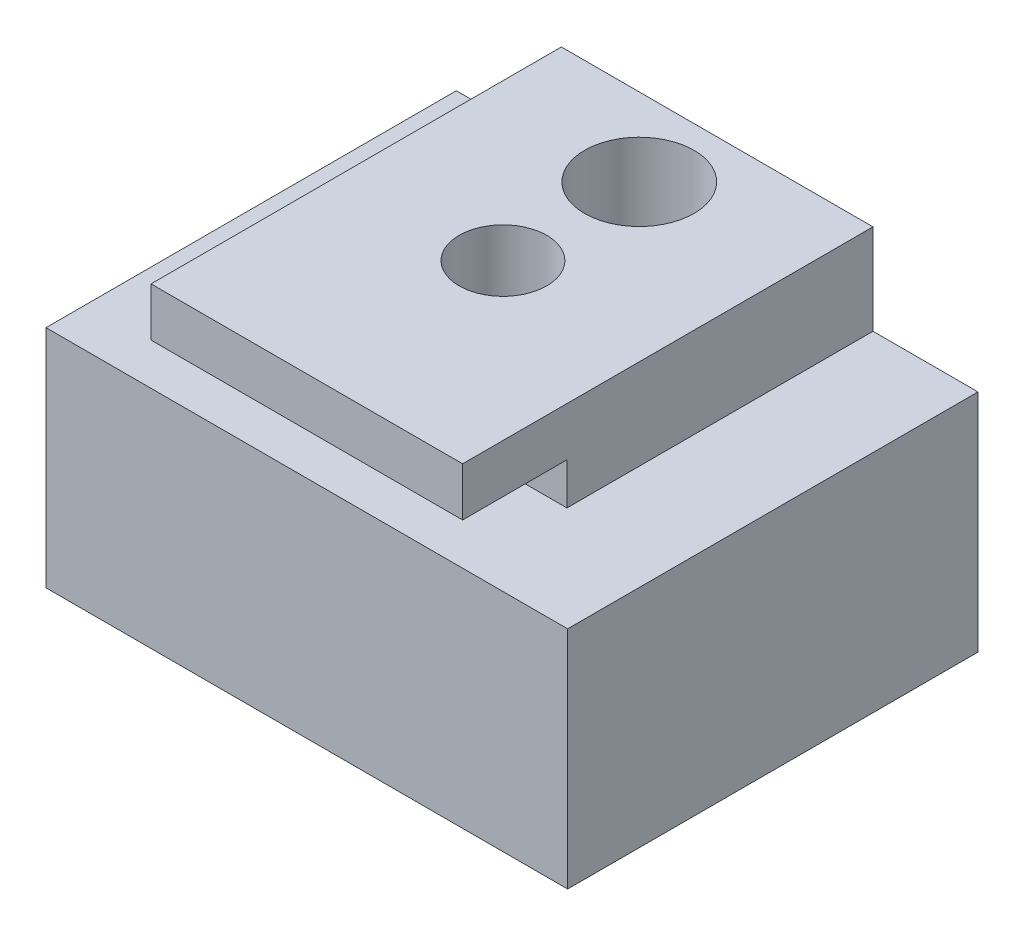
ISO-10303-21;
HEADER;
FILE_DESCRIPTION(('STEP AP214'),'2;1');
FILE_NAME('part.step','',(''),(''),'','','');
FILE_SCHEMA(('AUTOMOTIVE_DESIGN { 1 0 10303 214 1 1 1 1 }'));
ENDSEC;
DATA;
#1=APPLICATION_CONTEXT('core data for automotive mechanical design processes');
#2=APPLICATION_PROTOCOL_DEFINITION('international standard','automotive_design',2000,#1);
#3=PRODUCT_CONTEXT('',#1,'mechanical');
#4=PRODUCT('Part','Part','',(#3));
#5=PRODUCT_RELATED_PRODUCT_CATEGORY('part','',(#4));
#6=PRODUCT_DEFINITION_FORMATION('','',#4);
#7=PRODUCT_DEFINITION_CONTEXT('part definition',#1,'design');
#8=PRODUCT_DEFINITION('design','',#6,#7);
#9=PRODUCT_DEFINITION_SHAPE('','',#8);
#10=(LENGTH_UNIT() NAMED_UNIT(*) SI_UNIT(.MILLI.,.METRE.));
#11=(NAMED_UNIT(*) PLANE_ANGLE_UNIT() SI_UNIT($,.RADIAN.));
#12=(NAMED_UNIT(*) SI_UNIT($,.STERADIAN.) SOLID_ANGLE_UNIT());
#13=UNCERTAINTY_MEASURE_WITH_UNIT(LENGTH_MEASURE(1.E-05),#10,'distance_accuracy_value','');
#14=(GEOMETRIC_REPRESENTATION_CONTEXT(3) GLOBAL_UNCERTAINTY_ASSIGNED_CONTEXT((#13)) GLOBAL_UNIT_ASSIGNED_CONTEXT((#10,
#11,#12)) REPRESENTATION_CONTEXT('',''));
#15=CARTESIAN_POINT('',(0.,0.,0.));
#16=DIRECTION('',(0.,0.,1.));
#17=DIRECTION('',(1.,0.,0.));
#18=AXIS2_PLACEMENT_3D('',#15,#16,#17);
#19=CARTESIAN_POINT('',(-4.7625,2.0574,3.7465));
#20=DIRECTION('',(0.,0.,-1.));
#21=DIRECTION('',(-1.,0.,0.));
#22=AXIS2_PLACEMENT_3D('',#19,#20,#21);
#23=PLANE('',#22);
#24=DIRECTION('',(0.,-1.,0.));
#25=VECTOR('',#24,1.);
#26=CARTESIAN_POINT('',(-2.8448,3.7084,3.7465));
#27=LINE('',#26,#25);
#28=CARTESIAN_POINT('',(-2.8448,3.7084,3.7465));
#29=VERTEX_POINT('',#28);
#30=CARTESIAN_POINT('',(-2.8448,2.8194,3.7465));
#31=VERTEX_POINT('',#30);
#32=EDGE_CURVE('E161',#29,#31,#27,.T.);
#33=ORIENTED_EDGE('',*,*,#32,.T.);
#34=DIRECTION('',(1.,0.,0.));
#35=VECTOR('',#34,1.);
#36=CARTESIAN_POINT('',(-4.762525,2.8194,3.7465));
#37=LINE('',#36,#35);
#38=CARTESIAN_POINT('',(2.8448,2.8194,3.7465));
#39=VERTEX_POINT('',#38);
#40=EDGE_CURVE('E130',#31,#39,#37,.T.);
#41=ORIENTED_EDGE('',*,*,#40,.T.);
#42=DIRECTION('',(0.,-1.,0.));
#43=VECTOR('',#42,1.);
#44=CARTESIAN_POINT('',(2.8448,3.7084,3.7465));
#45=LINE('',#44,#43);
#46=CARTESIAN_POINT('',(2.8448,3.7084,3.7465));
#47=VERTEX_POINT('',#46);
#48=EDGE_CURVE('E165',#47,#39,#45,.T.);
#49=ORIENTED_EDGE('',*,*,#48,.F.);
#50=DIRECTION('',(1.,0.,0.));
#51=VECTOR('',#50,1.);
#52=CARTESIAN_POINT('',(2.8448,3.7084,3.7465));
#53=LINE('',#52,#51);
#54=EDGE_CURVE('E150',#29,#47,#53,.T.);
#55=ORIENTED_EDGE('',*,*,#54,.F.);
#56=EDGE_LOOP('',(#33,#41,#49,#55));
#57=FACE_BOUND('',#56,.T.);
#58=ADVANCED_FACE('F37',(#57),#23,.F.);
#59=CARTESIAN_POINT('',(-4.76249999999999,2.0574,-3.7465));
#60=DIRECTION('',(1.,0.,0.));
#61=DIRECTION('',(0.,0.,-1.));
#62=AXIS2_PLACEMENT_3D('',#59,#60,#61);
#63=PLANE('',#62);
#64=DIRECTION('',(0.,0.,1.));
#65=VECTOR('',#64,1.);
#66=CARTESIAN_POINT('',(-4.76249999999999,-2.0574,-3.7465));
#67=LINE('',#66,#65);
#68=CARTESIAN_POINT('',(-4.76249999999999,-2.0574,-3.7465));
#69=VERTEX_POINT('',#68);
#70=CARTESIAN_POINT('',(-4.7625,-2.0574,3.7465));
#71=VERTEX_POINT('',#70);
#72=EDGE_CURVE('E174',#69,#71,#67,.T.);
#73=ORIENTED_EDGE('',*,*,#72,.T.);
#74=DIRECTION('',(0.,-1.,0.));
#75=VECTOR('',#74,1.);
#76=CARTESIAN_POINT('',(-4.7625,2.0574,3.7465));
#77=LINE('',#76,#75);
#78=CARTESIAN_POINT('',(-4.7625,2.0574,3.7465));
#79=VERTEX_POINT('',#78);
#80=EDGE_CURVE('E179',#79,#71,#77,.T.);
#81=ORIENTED_EDGE('',*,*,#80,.F.);
#82=DIRECTION('',(0.,0.,1.));
#83=VECTOR('',#82,1.);
#84=CARTESIAN_POINT('',(-4.76249999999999,2.0574,-3.7465));
#85=LINE('',#84,#83);
#86=CARTESIAN_POINT('',(-4.76249999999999,2.0574,-3.7465));
#87=VERTEX_POINT('',#86);
#88=EDGE_CURVE('E154',#87,#79,#85,.T.);
#89=ORIENTED_EDGE('',*,*,#88,.F.);
#90=DIRECTION('',(0.,-1.,0.));
#91=VECTOR('',#90,1.);
#92=CARTESIAN_POINT('',(-4.76249999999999,2.0574,-3.7465));
#93=LINE('',#92,#91);
#94=EDGE_CURVE('E204',#87,#69,#93,.T.);
#95=ORIENTED_EDGE('',*,*,#94,.T.);
#96=EDGE_LOOP('',(#73,#81,#89,#95));
#97=FACE_BOUND('',#96,.T.);
#98=ADVANCED_FACE('F39',(#97),#63,.F.);
#99=DIRECTION('',(0.,-1.,0.));
#100=VECTOR('',#99,1.);
#101=CARTESIAN_POINT('',(4.7625,2.0574,3.7465));
#102=LINE('',#101,#100);
#103=CARTESIAN_POINT('',(4.7625,2.0574,3.7465));
#104=VERTEX_POINT('',#103);
#105=CARTESIAN_POINT('',(4.7625,-2.0574,3.7465));
#106=VERTEX_POINT('',#105);
#107=EDGE_CURVE('E146',#104,#106,#102,.T.);
#108=ORIENTED_EDGE('',*,*,#107,.F.);
#109=DIRECTION('',(1.,0.,0.));
#110=VECTOR('',#109,1.);
#111=CARTESIAN_POINT('',(-4.7625,2.0574,3.7465));
#112=LINE('',#111,#110);
#113=EDGE_CURVE('E192',#79,#104,#112,.T.);
#114=ORIENTED_EDGE('',*,*,#113,.F.);
#115=ORIENTED_EDGE('',*,*,#80,.T.);
#116=DIRECTION('',(1.,0.,0.));
#117=VECTOR('',#116,1.);
#118=CARTESIAN_POINT('',(-4.7625,-2.0574,3.7465));
#119=LINE('',#118,#117);
#120=EDGE_CURVE('E199',#71,#106,#119,.T.);
#121=ORIENTED_EDGE('',*,*,#120,.T.);
#122=EDGE_LOOP('',(#108,#114,#115,#121));
#123=FACE_BOUND('',#122,.T.);
#124=ADVANCED_FACE('F270',(#123),#23,.F.);
#125=CARTESIAN_POINT('',(4.7625,2.0574,-3.7465));
#126=DIRECTION('',(-1.,0.,0.));
#127=DIRECTION('',(0.,0.,1.));
#128=AXIS2_PLACEMENT_3D('',#125,#126,#127);
#129=PLANE('',#128);
#130=DIRECTION('',(0.,0.,-1.));
#131=VECTOR('',#130,1.);
#132=CARTESIAN_POINT('',(4.7625,-2.0574,-3.7465));
#133=LINE('',#132,#131);
#134=CARTESIAN_POINT('',(4.7625,-2.0574,-3.7465));
#135=VERTEX_POINT('',#134);
#136=EDGE_CURVE('E201',#106,#135,#133,.T.);
#137=ORIENTED_EDGE('',*,*,#136,.T.);
#138=DIRECTION('',(0.,-1.,0.));
#139=VECTOR('',#138,1.);
#140=CARTESIAN_POINT('',(4.7625,2.0574,-3.7465));
#141=LINE('',#140,#139);
#142=CARTESIAN_POINT('',(4.7625,2.0574,-3.7465));
#143=VERTEX_POINT('',#142);
#144=EDGE_CURVE('E188',#143,#135,#141,.T.);
#145=ORIENTED_EDGE('',*,*,#144,.F.);
#146=DIRECTION('',(0.,0.,-1.));
#147=VECTOR('',#146,1.);
#148=CARTESIAN_POINT('',(4.7625,2.0574,-3.7465));
#149=LINE('',#148,#147);
#150=EDGE_CURVE('E41',#104,#143,#149,.T.);
#151=ORIENTED_EDGE('',*,*,#150,.F.);
#152=ORIENTED_EDGE('',*,*,#107,.T.);
#153=EDGE_LOOP('',(#137,#145,#151,#152));
#154=FACE_BOUND('',#153,.T.);
#155=ADVANCED_FACE('F215',(#154),#129,.F.);
#156=CARTESIAN_POINT('',(-4.76249999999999,2.0574,-3.7465));
#157=DIRECTION('',(0.,0.,1.));
#158=DIRECTION('',(1.,0.,0.));
#159=AXIS2_PLACEMENT_3D('',#156,#157,#158);
#160=PLANE('',#159);
#161=DIRECTION('',(-1.,0.,0.));
#162=VECTOR('',#161,1.);
#163=CARTESIAN_POINT('',(-4.76249999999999,-2.0574,-3.7465));
#164=LINE('',#163,#162);
#165=EDGE_CURVE('E203',#135,#69,#164,.T.);
#166=ORIENTED_EDGE('',*,*,#165,.T.);
#167=ORIENTED_EDGE('',*,*,#94,.F.);
#168=DIRECTION('',(-1.,0.,0.));
#169=VECTOR('',#168,1.);
#170=CARTESIAN_POINT('',(-4.76249999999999,2.0574,-3.7465));
#171=LINE('',#170,#169);
#172=CARTESIAN_POINT('',(-2.8448,2.0574,-3.7465));
#173=VERTEX_POINT('',#172);
#174=EDGE_CURVE('E158',#173,#87,#171,.T.);
#175=ORIENTED_EDGE('',*,*,#174,.F.);
#176=DIRECTION('',(0.,-1.,0.));
#177=VECTOR('',#176,1.);
#178=CARTESIAN_POINT('',(-2.8448,3.7084,-3.7465));
#179=LINE('',#178,#177);
#180=CARTESIAN_POINT('',(-2.8448,3.7084,-3.7465));
#181=VERTEX_POINT('',#180);
#182=EDGE_CURVE('E164',#181,#173,#179,.T.);
#183=ORIENTED_EDGE('',*,*,#182,.F.);
#184=DIRECTION('',(-1.,0.,0.));
#185=VECTOR('',#184,1.);
#186=CARTESIAN_POINT('',(2.8448,3.7084,-3.7465));
#187=LINE('',#186,#185);
#188=CARTESIAN_POINT('',(2.8448,3.7084,-3.7465));
#189=VERTEX_POINT('',#188);
#190=EDGE_CURVE('E221',#189,#181,#187,.T.);
#191=ORIENTED_EDGE('',*,*,#190,.F.);
#192=DIRECTION('',(0.,-1.,0.));
#193=VECTOR('',#192,1.);
#194=CARTESIAN_POINT('',(2.8448,3.7084,-3.7465));
#195=LINE('',#194,#193);
#196=CARTESIAN_POINT('',(2.8448,2.0574,-3.7465));
#197=VERTEX_POINT('',#196);
#198=EDGE_CURVE('E170',#189,#197,#195,.T.);
#199=ORIENTED_EDGE('',*,*,#198,.T.);
#200=EDGE_CURVE('E134',#143,#197,#171,.T.);
#201=ORIENTED_EDGE('',*,*,#200,.F.);
#202=ORIENTED_EDGE('',*,*,#144,.T.);
#203=EDGE_LOOP('',(#166,#167,#175,#183,#191,#199,#201,#202));
#204=FACE_BOUND('',#203,.T.);
#205=ADVANCED_FACE('F219',(#204),#160,.F.);
#206=CARTESIAN_POINT('',(-4.76249999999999,2.0574,-3.7465));
#207=DIRECTION('',(0.,1.,0.));
#208=DIRECTION('',(0.,0.,1.));
#209=AXIS2_PLACEMENT_3D('',#206,#207,#208);
#210=PLANE('',#209);
#211=ORIENTED_EDGE('',*,*,#88,.T.);
#212=ORIENTED_EDGE('',*,*,#113,.T.);
#213=ORIENTED_EDGE('',*,*,#150,.T.);
#214=ORIENTED_EDGE('',*,*,#200,.T.);
#215=DIRECTION('',(0.,0.,-1.));
#216=VECTOR('',#215,1.);
#217=CARTESIAN_POINT('',(2.8448,2.0574,-3.7465));
#218=LINE('',#217,#216);
#219=CARTESIAN_POINT('',(2.8448,2.0574,1.8415));
#220=VERTEX_POINT('',#219);
#221=EDGE_CURVE('E127',#220,#197,#218,.T.);
#222=ORIENTED_EDGE('',*,*,#221,.F.);
#223=DIRECTION('',(1.,0.,0.));
#224=VECTOR('',#223,1.);
#225=CARTESIAN_POINT('',(-4.762525,2.0574,1.8415));
#226=LINE('',#225,#224);
#227=CARTESIAN_POINT('',(-2.8448,2.0574,1.8415));
#228=VERTEX_POINT('',#227);
#229=EDGE_CURVE('E55',#228,#220,#226,.T.);
#230=ORIENTED_EDGE('',*,*,#229,.F.);
#231=DIRECTION('',(0.,0.,1.));
#232=VECTOR('',#231,1.);
#233=CARTESIAN_POINT('',(-2.8448,2.0574,-3.7465));
#234=LINE('',#233,#232);
#235=EDGE_CURVE('E60',#173,#228,#234,.T.);
#236=ORIENTED_EDGE('',*,*,#235,.F.);
#237=ORIENTED_EDGE('',*,*,#174,.T.);
#238=EDGE_LOOP('',(#211,#212,#213,#214,#222,#230,#236,#237));
#239=FACE_BOUND('',#238,.T.);
#240=ADVANCED_FACE('F132',(#239),#210,.T.);
#241=CARTESIAN_POINT('',(-4.76249999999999,-2.0574,-3.7465));
#242=DIRECTION('',(0.,1.,0.));
#243=DIRECTION('',(0.,0.,1.));
#244=AXIS2_PLACEMENT_3D('',#241,#242,#243);
#245=PLANE('',#244);
#246=CARTESIAN_POINT('',(0.,-2.0574,0.165100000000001));
#247=DIRECTION('',(0.,1.,0.));
#248=DIRECTION('',(0.,0.,1.));
#249=AXIS2_PLACEMENT_3D('',#246,#247,#248);
#250=CIRCLE('',#249,0.799999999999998);
#251=CARTESIAN_POINT('',(0.,-2.0574,0.9651));
#252=VERTEX_POINT('',#251);
#253=EDGE_CURVE('E141',#252,#252,#250,.T.);
#254=ORIENTED_EDGE('',*,*,#253,.T.);
#255=EDGE_LOOP('',(#254));
#256=FACE_BOUND('',#255,.T.);
#257=ORIENTED_EDGE('',*,*,#72,.F.);
#258=ORIENTED_EDGE('',*,*,#165,.F.);
#259=ORIENTED_EDGE('',*,*,#136,.F.);
#260=ORIENTED_EDGE('',*,*,#120,.F.);
#261=EDGE_LOOP('',(#257,#258,#259,#260));
#262=FACE_BOUND('',#261,.T.);
#263=ADVANCED_FACE('F249',(#256,#262),#245,.F.);
#264=CARTESIAN_POINT('',(2.8448,3.7084,-3.7465));
#265=DIRECTION('',(-1.,0.,0.));
#266=DIRECTION('',(0.,0.,1.));
#267=AXIS2_PLACEMENT_3D('',#264,#265,#266);
#268=PLANE('',#267);
#269=ORIENTED_EDGE('',*,*,#48,.T.);
#270=DIRECTION('',(0.,0.,-1.));
#271=VECTOR('',#270,1.);
#272=CARTESIAN_POINT('',(2.8448,2.8194,-3.7465));
#273=LINE('',#272,#271);
#274=CARTESIAN_POINT('',(2.8448,2.8194,1.8415));
#275=VERTEX_POINT('',#274);
#276=EDGE_CURVE('E129',#39,#275,#273,.T.);
#277=ORIENTED_EDGE('',*,*,#276,.T.);
#278=DIRECTION('',(0.,-1.,0.));
#279=VECTOR('',#278,1.);
#280=CARTESIAN_POINT('',(2.8448,3.7084,1.8415));
#281=LINE('',#280,#279);
#282=EDGE_CURVE('E117',#275,#220,#281,.T.);
#283=ORIENTED_EDGE('',*,*,#282,.T.);
#284=ORIENTED_EDGE('',*,*,#221,.T.);
#285=ORIENTED_EDGE('',*,*,#198,.F.);
#286=DIRECTION('',(0.,0.,-1.));
#287=VECTOR('',#286,1.);
#288=CARTESIAN_POINT('',(2.8448,3.7084,-3.7465));
#289=LINE('',#288,#287);
#290=EDGE_CURVE('E138',#47,#189,#289,.T.);
#291=ORIENTED_EDGE('',*,*,#290,.F.);
#292=EDGE_LOOP('',(#269,#277,#283,#284,#285,#291));
#293=FACE_BOUND('',#292,.T.);
#294=ADVANCED_FACE('F125',(#293),#268,.F.);
#295=CARTESIAN_POINT('',(-2.8448,3.7084,-3.7465));
#296=DIRECTION('',(1.,0.,0.));
#297=DIRECTION('',(0.,0.,-1.));
#298=AXIS2_PLACEMENT_3D('',#295,#296,#297);
#299=PLANE('',#298);
#300=DIRECTION('',(0.,1.,0.));
#301=VECTOR('',#300,1.);
#302=CARTESIAN_POINT('',(-2.8448,3.7084,1.8415));
#303=LINE('',#302,#301);
#304=CARTESIAN_POINT('',(-2.8448,2.8194,1.8415));
#305=VERTEX_POINT('',#304);
#306=EDGE_CURVE('E47',#228,#305,#303,.T.);
#307=ORIENTED_EDGE('',*,*,#306,.T.);
#308=DIRECTION('',(0.,0.,1.));
#309=VECTOR('',#308,1.);
#310=CARTESIAN_POINT('',(-2.8448,2.8194,-3.7465));
#311=LINE('',#310,#309);
#312=EDGE_CURVE('E11',#305,#31,#311,.T.);
#313=ORIENTED_EDGE('',*,*,#312,.T.);
#314=ORIENTED_EDGE('',*,*,#32,.F.);
#315=DIRECTION('',(0.,0.,1.));
#316=VECTOR('',#315,1.);
#317=CARTESIAN_POINT('',(-2.8448,3.7084,-3.7465));
#318=LINE('',#317,#316);
#319=EDGE_CURVE('E227',#181,#29,#318,.T.);
#320=ORIENTED_EDGE('',*,*,#319,.F.);
#321=ORIENTED_EDGE('',*,*,#182,.T.);
#322=ORIENTED_EDGE('',*,*,#235,.T.);
#323=EDGE_LOOP('',(#307,#313,#314,#320,#321,#322));
#324=FACE_BOUND('',#323,.T.);
#325=ADVANCED_FACE('F260',(#324),#299,.F.);
#326=CARTESIAN_POINT('',(2.8448,3.7084,3.7465));
#327=DIRECTION('',(0.,-1.,0.));
#328=DIRECTION('',(0.,0.,-1.));
#329=AXIS2_PLACEMENT_3D('',#326,#327,#328);
#330=PLANE('',#329);
#331=CARTESIAN_POINT('',(0.,3.7084,-2.3241));
#332=DIRECTION('',(0.,1.,0.));
#333=DIRECTION('',(0.,0.,1.));
#334=AXIS2_PLACEMENT_3D('',#331,#332,#333);
#335=CIRCLE('',#334,0.99949);
#336=CARTESIAN_POINT('',(0.,3.7084,-1.32461));
#337=VERTEX_POINT('',#336);
#338=EDGE_CURVE('E241',#337,#337,#335,.T.);
#339=ORIENTED_EDGE('',*,*,#338,.F.);
#340=EDGE_LOOP('',(#339));
#341=FACE_BOUND('',#340,.T.);
#342=CARTESIAN_POINT('',(0.,3.7084,0.165100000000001));
#343=DIRECTION('',(0.,1.,0.));
#344=DIRECTION('',(0.,0.,1.));
#345=AXIS2_PLACEMENT_3D('',#342,#343,#344);
#346=CIRCLE('',#345,0.799999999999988);
#347=CARTESIAN_POINT('',(0.,3.7084,0.96509999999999));
#348=VERTEX_POINT('',#347);
#349=EDGE_CURVE('E136',#348,#348,#346,.T.);
#350=ORIENTED_EDGE('',*,*,#349,.F.);
#351=EDGE_LOOP('',(#350));
#352=FACE_BOUND('',#351,.T.);
#353=ORIENTED_EDGE('',*,*,#290,.T.);
#354=ORIENTED_EDGE('',*,*,#190,.T.);
#355=ORIENTED_EDGE('',*,*,#319,.T.);
#356=ORIENTED_EDGE('',*,*,#54,.T.);
#357=EDGE_LOOP('',(#353,#354,#355,#356));
#358=FACE_BOUND('',#357,.T.);
#359=ADVANCED_FACE('F233',(#341,#352,#358),#330,.F.);
#360=CARTESIAN_POINT('',(0.,3.7084,0.165100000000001));
#361=DIRECTION('',(0.,1.,0.));
#362=DIRECTION('',(0.,0.,1.));
#363=AXIS2_PLACEMENT_3D('',#360,#361,#362);
#364=CYLINDRICAL_SURFACE('',#363,0.799999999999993);
#365=ORIENTED_EDGE('',*,*,#253,.F.);
#366=EDGE_LOOP('',(#365));
#367=FACE_BOUND('',#366,.T.);
#368=ORIENTED_EDGE('',*,*,#349,.T.);
#369=EDGE_LOOP('',(#368));
#370=FACE_BOUND('',#369,.T.);
#371=ADVANCED_FACE('F252',(#367,#370),#364,.F.);
#372=CARTESIAN_POINT('',(0.,2.1209,-2.3241));
#373=DIRECTION('',(0.,1.,0.));
#374=DIRECTION('',(0.,0.,1.));
#375=AXIS2_PLACEMENT_3D('',#372,#373,#374);
#376=CYLINDRICAL_SURFACE('',#375,0.99949);
#377=CARTESIAN_POINT('',(0.,2.1209,-2.3241));
#378=DIRECTION('',(0.,1.,0.));
#379=DIRECTION('',(0.,0.,1.));
#380=AXIS2_PLACEMENT_3D('',#377,#378,#379);
#381=CIRCLE('',#380,0.99949);
#382=CARTESIAN_POINT('',(0.,2.1209,-1.32461));
#383=VERTEX_POINT('',#382);
#384=EDGE_CURVE('E242',#383,#383,#381,.T.);
#385=ORIENTED_EDGE('',*,*,#384,.F.);
#386=EDGE_LOOP('',(#385));
#387=FACE_BOUND('',#386,.T.);
#388=ORIENTED_EDGE('',*,*,#338,.T.);
#389=EDGE_LOOP('',(#388));
#390=FACE_BOUND('',#389,.T.);
#391=ADVANCED_FACE('F255',(#387,#390),#376,.F.);
#392=CARTESIAN_POINT('',(0.,2.1209,-2.3241));
#393=DIRECTION('',(0.,1.,0.));
#394=DIRECTION('',(0.,0.,1.));
#395=AXIS2_PLACEMENT_3D('',#392,#393,#394);
#396=PLANE('',#395);
#397=ORIENTED_EDGE('',*,*,#384,.T.);
#398=EDGE_LOOP('',(#397));
#399=FACE_BOUND('',#398,.T.);
#400=ADVANCED_FACE('F282',(#399),#396,.T.);
#401=CARTESIAN_POINT('',(-4.762525,2.8194,3.7465));
#402=DIRECTION('',(0.,1.,0.));
#403=DIRECTION('',(0.,0.,1.));
#404=AXIS2_PLACEMENT_3D('',#401,#402,#403);
#405=PLANE('',#404);
#406=ORIENTED_EDGE('',*,*,#40,.F.);
#407=ORIENTED_EDGE('',*,*,#312,.F.);
#408=DIRECTION('',(1.,0.,0.));
#409=VECTOR('',#408,1.);
#410=CARTESIAN_POINT('',(-4.762525,2.8194,1.8415));
#411=LINE('',#410,#409);
#412=EDGE_CURVE('E120',#305,#275,#411,.T.);
#413=ORIENTED_EDGE('',*,*,#412,.T.);
#414=ORIENTED_EDGE('',*,*,#276,.F.);
#415=EDGE_LOOP('',(#406,#407,#413,#414));
#416=FACE_BOUND('',#415,.T.);
#417=ADVANCED_FACE('F280',(#416),#405,.F.);
#418=CARTESIAN_POINT('',(-4.762525,2.8194,1.8415));
#419=DIRECTION('',(0.,0.,-1.));
#420=DIRECTION('',(0.,1.,0.));
#421=AXIS2_PLACEMENT_3D('',#418,#419,#420);
#422=PLANE('',#421);
#423=ORIENTED_EDGE('',*,*,#412,.F.);
#424=ORIENTED_EDGE('',*,*,#306,.F.);
#425=ORIENTED_EDGE('',*,*,#229,.T.);
#426=ORIENTED_EDGE('',*,*,#282,.F.);
#427=EDGE_LOOP('',(#423,#424,#425,#426));
#428=FACE_BOUND('',#427,.T.);
#429=ADVANCED_FACE('F116',(#428),#422,.F.);
#430=CLOSED_SHELL('',(#58,#98,#124,#155,#205,#240,#263,#294,#325,#359,#371,#391,#400,#417,#429));
#431=MANIFOLD_SOLID_BREP('B2',#430);
#432=ADVANCED_BREP_SHAPE_REPRESENTATION('',(#18,#431),#14);
#433=SHAPE_DEFINITION_REPRESENTATION(#9,#432);
ENDSEC;
END-ISO-10303-21;
